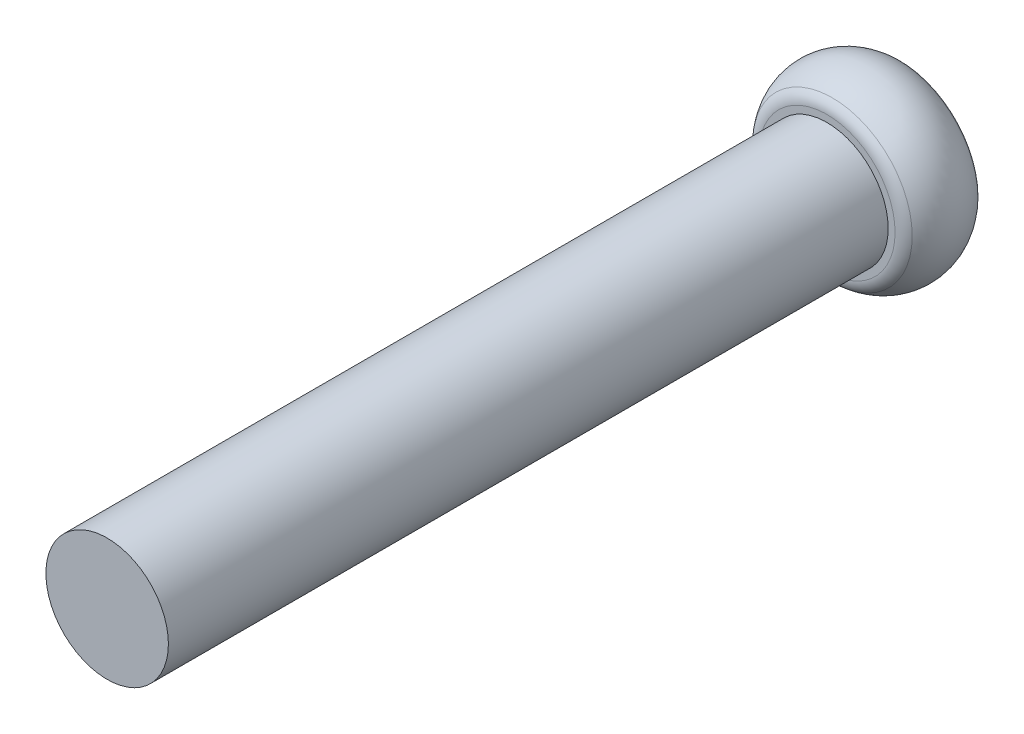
ISO-10303-21;
HEADER;
FILE_DESCRIPTION(('STEP AP214'),'2;1');
FILE_NAME('part.step','',(''),(''),'','','');
FILE_SCHEMA(('AUTOMOTIVE_DESIGN { 1 0 10303 214 1 1 1 1 }'));
ENDSEC;
DATA;
#1=APPLICATION_CONTEXT('core data for automotive mechanical design processes');
#2=APPLICATION_PROTOCOL_DEFINITION('international standard','automotive_design',2000,#1);
#3=PRODUCT_CONTEXT('',#1,'mechanical');
#4=PRODUCT('Part','Part','',(#3));
#5=PRODUCT_RELATED_PRODUCT_CATEGORY('part','',(#4));
#6=PRODUCT_DEFINITION_FORMATION('','',#4);
#7=PRODUCT_DEFINITION_CONTEXT('part definition',#1,'design');
#8=PRODUCT_DEFINITION('design','',#6,#7);
#9=PRODUCT_DEFINITION_SHAPE('','',#8);
#10=(LENGTH_UNIT() NAMED_UNIT(*) SI_UNIT(.MILLI.,.METRE.));
#11=(NAMED_UNIT(*) PLANE_ANGLE_UNIT() SI_UNIT($,.RADIAN.));
#12=(NAMED_UNIT(*) SI_UNIT($,.STERADIAN.) SOLID_ANGLE_UNIT());
#13=UNCERTAINTY_MEASURE_WITH_UNIT(LENGTH_MEASURE(1.E-05),#10,'distance_accuracy_value','');
#14=(GEOMETRIC_REPRESENTATION_CONTEXT(3) GLOBAL_UNCERTAINTY_ASSIGNED_CONTEXT((#13)) GLOBAL_UNIT_ASSIGNED_CONTEXT((#10,
#11,#12)) REPRESENTATION_CONTEXT('',''));
#15=CARTESIAN_POINT('',(0.,0.,0.));
#16=DIRECTION('',(0.,0.,1.));
#17=DIRECTION('',(1.,0.,0.));
#18=AXIS2_PLACEMENT_3D('',#15,#16,#17);
#19=CARTESIAN_POINT('',(0.,0.,-10.9468599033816));
#20=DIRECTION('',(0.,0.,1.));
#21=DIRECTION('',(1.,0.,0.));
#22=AXIS2_PLACEMENT_3D('',#19,#20,#21);
#23=PLANE('',#22);
#24=DIRECTION('',(0.923879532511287,0.38268343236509,0.));
#25=VECTOR('',#24,1.);
#26=CARTESIAN_POINT('',(0.,2.,-10.9468599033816));
#27=LINE('',#26,#25);
#28=CARTESIAN_POINT('',(-1.4142135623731,1.4142135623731,-10.9468599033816));
#29=VERTEX_POINT('',#28);
#30=CARTESIAN_POINT('',(0.,2.,-10.9468599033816));
#31=VERTEX_POINT('',#30);
#32=EDGE_CURVE('E137',#29,#31,#27,.T.);
#33=ORIENTED_EDGE('',*,*,#32,.F.);
#34=DIRECTION('',(0.38268343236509,0.923879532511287,0.));
#35=VECTOR('',#34,1.);
#36=CARTESIAN_POINT('',(-1.4142135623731,1.4142135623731,-10.9468599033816));
#37=LINE('',#36,#35);
#38=CARTESIAN_POINT('',(-2.,0.,-10.9468599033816));
#39=VERTEX_POINT('',#38);
#40=EDGE_CURVE('E51',#39,#29,#37,.T.);
#41=ORIENTED_EDGE('',*,*,#40,.F.);
#42=DIRECTION('',(-0.38268343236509,0.923879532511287,0.));
#43=VECTOR('',#42,1.);
#44=CARTESIAN_POINT('',(-2.,0.,-10.9468599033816));
#45=LINE('',#44,#43);
#46=CARTESIAN_POINT('',(-1.4142135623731,-1.41421356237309,-10.9468599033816));
#47=VERTEX_POINT('',#46);
#48=EDGE_CURVE('E152',#47,#39,#45,.T.);
#49=ORIENTED_EDGE('',*,*,#48,.F.);
#50=DIRECTION('',(-0.923879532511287,0.38268343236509,0.));
#51=VECTOR('',#50,1.);
#52=CARTESIAN_POINT('',(-1.4142135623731,-1.41421356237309,-10.9468599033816));
#53=LINE('',#52,#51);
#54=CARTESIAN_POINT('',(0.,-2.,-10.9468599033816));
#55=VERTEX_POINT('',#54);
#56=EDGE_CURVE('E150',#55,#47,#53,.T.);
#57=ORIENTED_EDGE('',*,*,#56,.F.);
#58=DIRECTION('',(-0.923879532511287,-0.38268343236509,0.));
#59=VECTOR('',#58,1.);
#60=CARTESIAN_POINT('',(0.,-2.,-10.9468599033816));
#61=LINE('',#60,#59);
#62=CARTESIAN_POINT('',(1.41421356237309,-1.4142135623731,-10.9468599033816));
#63=VERTEX_POINT('',#62);
#64=EDGE_CURVE('E111',#63,#55,#61,.T.);
#65=ORIENTED_EDGE('',*,*,#64,.F.);
#66=DIRECTION('',(-0.38268343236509,-0.923879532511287,0.));
#67=VECTOR('',#66,1.);
#68=CARTESIAN_POINT('',(1.41421356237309,-1.4142135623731,-10.9468599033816));
#69=LINE('',#68,#67);
#70=CARTESIAN_POINT('',(2.,0.,-10.9468599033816));
#71=VERTEX_POINT('',#70);
#72=EDGE_CURVE('E146',#71,#63,#69,.T.);
#73=ORIENTED_EDGE('',*,*,#72,.F.);
#74=DIRECTION('',(0.38268343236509,-0.923879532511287,0.));
#75=VECTOR('',#74,1.);
#76=CARTESIAN_POINT('',(2.,0.,-10.9468599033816));
#77=LINE('',#76,#75);
#78=CARTESIAN_POINT('',(1.4142135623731,1.41421356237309,-10.9468599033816));
#79=VERTEX_POINT('',#78);
#80=EDGE_CURVE('E143',#79,#71,#77,.T.);
#81=ORIENTED_EDGE('',*,*,#80,.F.);
#82=DIRECTION('',(0.923879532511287,-0.38268343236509,0.));
#83=VECTOR('',#82,1.);
#84=CARTESIAN_POINT('',(1.4142135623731,1.41421356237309,-10.9468599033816));
#85=LINE('',#84,#83);
#86=EDGE_CURVE('E140',#31,#79,#85,.T.);
#87=ORIENTED_EDGE('',*,*,#86,.F.);
#88=EDGE_LOOP('',(#33,#41,#49,#57,#65,#73,#81,#87));
#89=FACE_BOUND('',#88,.T.);
#90=CARTESIAN_POINT('',(0.,0.,-10.9468599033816));
#91=DIRECTION('',(0.,0.,1.));
#92=DIRECTION('',(1.,0.,0.));
#93=AXIS2_PLACEMENT_3D('',#90,#91,#92);
#94=CIRCLE('',#93,2.22590437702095);
#95=CARTESIAN_POINT('',(2.22590437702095,0.,-10.9468599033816));
#96=VERTEX_POINT('',#95);
#97=EDGE_CURVE('E11',#96,#96,#94,.T.);
#98=ORIENTED_EDGE('',*,*,#97,.F.);
#99=EDGE_LOOP('',(#98));
#100=FACE_BOUND('',#99,.T.);
#101=ADVANCED_FACE('F37',(#89,#100),#23,.F.);
#102=CARTESIAN_POINT('',(0.,0.,-10.4468599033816));
#103=DIRECTION('',(0.,0.,1.));
#104=DIRECTION('',(1.,0.,0.));
#105=AXIS2_PLACEMENT_3D('',#102,#103,#104);
#106=TOROIDAL_SURFACE('',#105,2.22590437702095,0.500000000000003);
#107=CARTESIAN_POINT('',(0.,0.,-10.7692604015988));
#108=DIRECTION('',(0.,0.,1.));
#109=DIRECTION('',(1.,0.,0.));
#110=AXIS2_PLACEMENT_3D('',#107,#108,#109);
#111=CIRCLE('',#110,2.60807962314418);
#112=CARTESIAN_POINT('',(2.60807962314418,0.,-10.7692604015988));
#113=VERTEX_POINT('',#112);
#114=EDGE_CURVE('E44',#113,#113,#111,.T.);
#115=ORIENTED_EDGE('',*,*,#114,.F.);
#116=EDGE_LOOP('',(#115));
#117=FACE_BOUND('',#116,.T.);
#118=ORIENTED_EDGE('',*,*,#97,.T.);
#119=EDGE_LOOP('',(#118));
#120=FACE_BOUND('',#119,.T.);
#121=ADVANCED_FACE('F181',(#117,#120),#106,.T.);
#122=CARTESIAN_POINT('',(0.,0.,-9.69685990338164));
#123=DIRECTION('',(0.,0.,1.));
#124=DIRECTION('',(1.,0.,0.));
#125=AXIS2_PLACEMENT_3D('',#122,#123,#124);
#126=DEGENERATE_TOROIDAL_SURFACE('',#125,1.33685043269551,1.66314956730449,.T.);
#127=CARTESIAN_POINT('',(0.,0.,-8.62445940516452));
#128=DIRECTION('',(0.,0.,1.));
#129=DIRECTION('',(1.,0.,0.));
#130=AXIS2_PLACEMENT_3D('',#127,#128,#129);
#131=CIRCLE('',#130,2.60807962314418);
#132=CARTESIAN_POINT('',(2.60807962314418,0.,-8.62445940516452));
#133=VERTEX_POINT('',#132);
#134=EDGE_CURVE('E174',#133,#133,#131,.T.);
#135=ORIENTED_EDGE('',*,*,#134,.F.);
#136=EDGE_LOOP('',(#135));
#137=FACE_BOUND('',#136,.T.);
#138=ORIENTED_EDGE('',*,*,#114,.T.);
#139=EDGE_LOOP('',(#138));
#140=FACE_BOUND('',#139,.T.);
#141=ADVANCED_FACE('F179',(#137,#140),#126,.T.);
#142=CARTESIAN_POINT('',(0.,0.,-8.94685990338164));
#143=DIRECTION('',(0.,0.,1.));
#144=DIRECTION('',(1.,0.,0.));
#145=AXIS2_PLACEMENT_3D('',#142,#143,#144);
#146=TOROIDAL_SURFACE('',#145,2.22590437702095,0.500000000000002);
#147=CARTESIAN_POINT('',(0.,0.,-8.44685990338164));
#148=DIRECTION('',(0.,0.,1.));
#149=DIRECTION('',(1.,0.,0.));
#150=AXIS2_PLACEMENT_3D('',#147,#148,#149);
#151=CIRCLE('',#150,2.22590437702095);
#152=CARTESIAN_POINT('',(2.22590437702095,0.,-8.44685990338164));
#153=VERTEX_POINT('',#152);
#154=EDGE_CURVE('E171',#153,#153,#151,.T.);
#155=ORIENTED_EDGE('',*,*,#154,.F.);
#156=EDGE_LOOP('',(#155));
#157=FACE_BOUND('',#156,.T.);
#158=ORIENTED_EDGE('',*,*,#134,.T.);
#159=EDGE_LOOP('',(#158));
#160=FACE_BOUND('',#159,.T.);
#161=ADVANCED_FACE('F245',(#157,#160),#146,.T.);
#162=CARTESIAN_POINT('',(0.,2.,-8.44685990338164));
#163=DIRECTION('',(0.,0.,-1.));
#164=DIRECTION('',(-1.,0.,0.));
#165=AXIS2_PLACEMENT_3D('',#162,#163,#164);
#166=PLANE('',#165);
#167=CARTESIAN_POINT('',(0.,0.,-8.44685990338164));
#168=DIRECTION('',(0.,0.,1.));
#169=DIRECTION('',(1.,0.,0.));
#170=AXIS2_PLACEMENT_3D('',#167,#168,#169);
#171=CIRCLE('',#170,2.);
#172=CARTESIAN_POINT('',(2.,0.,-8.44685990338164));
#173=VERTEX_POINT('',#172);
#174=EDGE_CURVE('E168',#173,#173,#171,.T.);
#175=ORIENTED_EDGE('',*,*,#174,.F.);
#176=EDGE_LOOP('',(#175));
#177=FACE_BOUND('',#176,.T.);
#178=ORIENTED_EDGE('',*,*,#154,.T.);
#179=EDGE_LOOP('',(#178));
#180=FACE_BOUND('',#179,.T.);
#181=ADVANCED_FACE('F241',(#177,#180),#166,.F.);
#182=CARTESIAN_POINT('',(0.,0.,15.0531400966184));
#183=DIRECTION('',(0.,0.,1.));
#184=DIRECTION('',(1.,0.,0.));
#185=AXIS2_PLACEMENT_3D('',#182,#183,#184);
#186=CYLINDRICAL_SURFACE('',#185,2.);
#187=CARTESIAN_POINT('',(0.,0.,15.0531400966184));
#188=DIRECTION('',(0.,0.,1.));
#189=DIRECTION('',(1.,0.,0.));
#190=AXIS2_PLACEMENT_3D('',#187,#188,#189);
#191=CIRCLE('',#190,2.);
#192=CARTESIAN_POINT('',(2.,0.,15.0531400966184));
#193=VERTEX_POINT('',#192);
#194=EDGE_CURVE('E156',#193,#193,#191,.T.);
#195=ORIENTED_EDGE('',*,*,#194,.F.);
#196=EDGE_LOOP('',(#195));
#197=FACE_BOUND('',#196,.T.);
#198=ORIENTED_EDGE('',*,*,#174,.T.);
#199=EDGE_LOOP('',(#198));
#200=FACE_BOUND('',#199,.T.);
#201=ADVANCED_FACE('F237',(#197,#200),#186,.T.);
#202=CARTESIAN_POINT('',(0.,2.,15.0531400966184));
#203=DIRECTION('',(0.,0.,-1.));
#204=DIRECTION('',(-1.,0.,0.));
#205=AXIS2_PLACEMENT_3D('',#202,#203,#204);
#206=PLANE('',#205);
#207=ORIENTED_EDGE('',*,*,#194,.T.);
#208=EDGE_LOOP('',(#207));
#209=FACE_BOUND('',#208,.T.);
#210=ADVANCED_FACE('F219',(#209),#206,.F.);
#211=CARTESIAN_POINT('',(-1.4142135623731,1.4142135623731,-9.44685990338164));
#212=DIRECTION('',(-0.923879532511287,0.38268343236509,0.));
#213=DIRECTION('',(-0.38268343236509,-0.923879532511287,0.));
#214=AXIS2_PLACEMENT_3D('',#211,#212,#213);
#215=PLANE('',#214);
#216=ORIENTED_EDGE('',*,*,#40,.T.);
#217=DIRECTION('',(0.,0.,-1.));
#218=VECTOR('',#217,1.);
#219=CARTESIAN_POINT('',(-1.4142135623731,1.4142135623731,-9.44685990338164));
#220=LINE('',#219,#218);
#221=CARTESIAN_POINT('',(-1.4142135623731,1.4142135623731,-9.44685990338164));
#222=VERTEX_POINT('',#221);
#223=EDGE_CURVE('E87',#222,#29,#220,.T.);
#224=ORIENTED_EDGE('',*,*,#223,.F.);
#225=DIRECTION('',(0.38268343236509,0.923879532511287,0.));
#226=VECTOR('',#225,1.);
#227=CARTESIAN_POINT('',(-1.4142135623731,1.4142135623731,-9.44685990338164));
#228=LINE('',#227,#226);
#229=CARTESIAN_POINT('',(-2.,0.,-9.44685990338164));
#230=VERTEX_POINT('',#229);
#231=EDGE_CURVE('E154',#230,#222,#228,.T.);
#232=ORIENTED_EDGE('',*,*,#231,.F.);
#233=DIRECTION('',(0.,0.,-1.));
#234=VECTOR('',#233,1.);
#235=CARTESIAN_POINT('',(-2.,0.,-9.44685990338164));
#236=LINE('',#235,#234);
#237=EDGE_CURVE('E59',#230,#39,#236,.T.);
#238=ORIENTED_EDGE('',*,*,#237,.T.);
#239=EDGE_LOOP('',(#216,#224,#232,#238));
#240=FACE_BOUND('',#239,.T.);
#241=ADVANCED_FACE('F212',(#240),#215,.F.);
#242=CARTESIAN_POINT('',(-2.,0.,-9.44685990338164));
#243=DIRECTION('',(-0.923879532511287,-0.38268343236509,0.));
#244=DIRECTION('',(0.38268343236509,-0.923879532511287,0.));
#245=AXIS2_PLACEMENT_3D('',#242,#243,#244);
#246=PLANE('',#245);
#247=ORIENTED_EDGE('',*,*,#48,.T.);
#248=ORIENTED_EDGE('',*,*,#237,.F.);
#249=DIRECTION('',(-0.38268343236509,0.923879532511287,0.));
#250=VECTOR('',#249,1.);
#251=CARTESIAN_POINT('',(-2.,0.,-9.44685990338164));
#252=LINE('',#251,#250);
#253=CARTESIAN_POINT('',(-1.4142135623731,-1.41421356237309,-9.44685990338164));
#254=VERTEX_POINT('',#253);
#255=EDGE_CURVE('E123',#254,#230,#252,.T.);
#256=ORIENTED_EDGE('',*,*,#255,.F.);
#257=DIRECTION('',(0.,0.,-1.));
#258=VECTOR('',#257,1.);
#259=CARTESIAN_POINT('',(-1.4142135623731,-1.41421356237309,-9.44685990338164));
#260=LINE('',#259,#258);
#261=EDGE_CURVE('E115',#254,#47,#260,.T.);
#262=ORIENTED_EDGE('',*,*,#261,.T.);
#263=EDGE_LOOP('',(#247,#248,#256,#262));
#264=FACE_BOUND('',#263,.T.);
#265=ADVANCED_FACE('F210',(#264),#246,.F.);
#266=CARTESIAN_POINT('',(-1.4142135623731,-1.41421356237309,-9.44685990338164));
#267=DIRECTION('',(-0.38268343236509,-0.923879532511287,0.));
#268=DIRECTION('',(0.923879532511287,-0.38268343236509,0.));
#269=AXIS2_PLACEMENT_3D('',#266,#267,#268);
#270=PLANE('',#269);
#271=ORIENTED_EDGE('',*,*,#56,.T.);
#272=ORIENTED_EDGE('',*,*,#261,.F.);
#273=DIRECTION('',(-0.923879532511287,0.38268343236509,0.));
#274=VECTOR('',#273,1.);
#275=CARTESIAN_POINT('',(-1.4142135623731,-1.41421356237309,-9.44685990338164));
#276=LINE('',#275,#274);
#277=CARTESIAN_POINT('',(0.,-2.,-9.44685990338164));
#278=VERTEX_POINT('',#277);
#279=EDGE_CURVE('E119',#278,#254,#276,.T.);
#280=ORIENTED_EDGE('',*,*,#279,.F.);
#281=DIRECTION('',(0.,0.,-1.));
#282=VECTOR('',#281,1.);
#283=CARTESIAN_POINT('',(0.,-2.,-9.44685990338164));
#284=LINE('',#283,#282);
#285=EDGE_CURVE('E104',#278,#55,#284,.T.);
#286=ORIENTED_EDGE('',*,*,#285,.T.);
#287=EDGE_LOOP('',(#271,#272,#280,#286));
#288=FACE_BOUND('',#287,.T.);
#289=ADVANCED_FACE('F120',(#288),#270,.F.);
#290=CARTESIAN_POINT('',(0.,-2.,-9.44685990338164));
#291=DIRECTION('',(0.38268343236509,-0.923879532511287,0.));
#292=DIRECTION('',(0.923879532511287,0.38268343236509,0.));
#293=AXIS2_PLACEMENT_3D('',#290,#291,#292);
#294=PLANE('',#293);
#295=ORIENTED_EDGE('',*,*,#64,.T.);
#296=ORIENTED_EDGE('',*,*,#285,.F.);
#297=DIRECTION('',(-0.923879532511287,-0.38268343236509,0.));
#298=VECTOR('',#297,1.);
#299=CARTESIAN_POINT('',(0.,-2.,-9.44685990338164));
#300=LINE('',#299,#298);
#301=CARTESIAN_POINT('',(1.41421356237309,-1.4142135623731,-9.44685990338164));
#302=VERTEX_POINT('',#301);
#303=EDGE_CURVE('E108',#302,#278,#300,.T.);
#304=ORIENTED_EDGE('',*,*,#303,.F.);
#305=DIRECTION('',(0.,0.,-1.));
#306=VECTOR('',#305,1.);
#307=CARTESIAN_POINT('',(1.41421356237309,-1.4142135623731,-9.44685990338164));
#308=LINE('',#307,#306);
#309=EDGE_CURVE('E116',#302,#63,#308,.T.);
#310=ORIENTED_EDGE('',*,*,#309,.T.);
#311=EDGE_LOOP('',(#295,#296,#304,#310));
#312=FACE_BOUND('',#311,.T.);
#313=ADVANCED_FACE('F106',(#312),#294,.F.);
#314=CARTESIAN_POINT('',(1.41421356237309,-1.4142135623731,-9.44685990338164));
#315=DIRECTION('',(0.923879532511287,-0.38268343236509,0.));
#316=DIRECTION('',(0.38268343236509,0.923879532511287,0.));
#317=AXIS2_PLACEMENT_3D('',#314,#315,#316);
#318=PLANE('',#317);
#319=ORIENTED_EDGE('',*,*,#72,.T.);
#320=ORIENTED_EDGE('',*,*,#309,.F.);
#321=DIRECTION('',(-0.38268343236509,-0.923879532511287,0.));
#322=VECTOR('',#321,1.);
#323=CARTESIAN_POINT('',(1.41421356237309,-1.4142135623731,-9.44685990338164));
#324=LINE('',#323,#322);
#325=CARTESIAN_POINT('',(2.,0.,-9.44685990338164));
#326=VERTEX_POINT('',#325);
#327=EDGE_CURVE('E129',#326,#302,#324,.T.);
#328=ORIENTED_EDGE('',*,*,#327,.F.);
#329=DIRECTION('',(0.,0.,-1.));
#330=VECTOR('',#329,1.);
#331=CARTESIAN_POINT('',(2.,0.,-9.44685990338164));
#332=LINE('',#331,#330);
#333=EDGE_CURVE('E159',#326,#71,#332,.T.);
#334=ORIENTED_EDGE('',*,*,#333,.T.);
#335=EDGE_LOOP('',(#319,#320,#328,#334));
#336=FACE_BOUND('',#335,.T.);
#337=ADVANCED_FACE('F209',(#336),#318,.F.);
#338=CARTESIAN_POINT('',(2.,0.,-9.44685990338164));
#339=DIRECTION('',(0.923879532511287,0.38268343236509,0.));
#340=DIRECTION('',(-0.38268343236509,0.923879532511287,0.));
#341=AXIS2_PLACEMENT_3D('',#338,#339,#340);
#342=PLANE('',#341);
#343=ORIENTED_EDGE('',*,*,#80,.T.);
#344=ORIENTED_EDGE('',*,*,#333,.F.);
#345=DIRECTION('',(0.38268343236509,-0.923879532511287,0.));
#346=VECTOR('',#345,1.);
#347=CARTESIAN_POINT('',(2.,0.,-9.44685990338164));
#348=LINE('',#347,#346);
#349=CARTESIAN_POINT('',(1.4142135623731,1.41421356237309,-9.44685990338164));
#350=VERTEX_POINT('',#349);
#351=EDGE_CURVE('E131',#350,#326,#348,.T.);
#352=ORIENTED_EDGE('',*,*,#351,.F.);
#353=DIRECTION('',(0.,0.,-1.));
#354=VECTOR('',#353,1.);
#355=CARTESIAN_POINT('',(1.4142135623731,1.41421356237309,-9.44685990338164));
#356=LINE('',#355,#354);
#357=EDGE_CURVE('E161',#350,#79,#356,.T.);
#358=ORIENTED_EDGE('',*,*,#357,.T.);
#359=EDGE_LOOP('',(#343,#344,#352,#358));
#360=FACE_BOUND('',#359,.T.);
#361=ADVANCED_FACE('F206',(#360),#342,.F.);
#362=CARTESIAN_POINT('',(1.4142135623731,1.41421356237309,-9.44685990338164));
#363=DIRECTION('',(0.38268343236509,0.923879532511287,0.));
#364=DIRECTION('',(-0.923879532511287,0.38268343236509,0.));
#365=AXIS2_PLACEMENT_3D('',#362,#363,#364);
#366=PLANE('',#365);
#367=ORIENTED_EDGE('',*,*,#86,.T.);
#368=ORIENTED_EDGE('',*,*,#357,.F.);
#369=DIRECTION('',(0.923879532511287,-0.38268343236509,0.));
#370=VECTOR('',#369,1.);
#371=CARTESIAN_POINT('',(1.4142135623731,1.41421356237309,-9.44685990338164));
#372=LINE('',#371,#370);
#373=CARTESIAN_POINT('',(0.,2.,-9.44685990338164));
#374=VERTEX_POINT('',#373);
#375=EDGE_CURVE('E200',#374,#350,#372,.T.);
#376=ORIENTED_EDGE('',*,*,#375,.F.);
#377=DIRECTION('',(0.,0.,-1.));
#378=VECTOR('',#377,1.);
#379=CARTESIAN_POINT('',(0.,2.,-9.44685990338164));
#380=LINE('',#379,#378);
#381=EDGE_CURVE('E163',#374,#31,#380,.T.);
#382=ORIENTED_EDGE('',*,*,#381,.T.);
#383=EDGE_LOOP('',(#367,#368,#376,#382));
#384=FACE_BOUND('',#383,.T.);
#385=ADVANCED_FACE('F229',(#384),#366,.F.);
#386=CARTESIAN_POINT('',(0.,2.,-9.44685990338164));
#387=DIRECTION('',(-0.38268343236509,0.923879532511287,0.));
#388=DIRECTION('',(-0.923879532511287,-0.38268343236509,0.));
#389=AXIS2_PLACEMENT_3D('',#386,#387,#388);
#390=PLANE('',#389);
#391=ORIENTED_EDGE('',*,*,#32,.T.);
#392=ORIENTED_EDGE('',*,*,#381,.F.);
#393=DIRECTION('',(0.923879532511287,0.38268343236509,0.));
#394=VECTOR('',#393,1.);
#395=CARTESIAN_POINT('',(0.,2.,-9.44685990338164));
#396=LINE('',#395,#394);
#397=EDGE_CURVE('E198',#222,#374,#396,.T.);
#398=ORIENTED_EDGE('',*,*,#397,.F.);
#399=ORIENTED_EDGE('',*,*,#223,.T.);
#400=EDGE_LOOP('',(#391,#392,#398,#399));
#401=FACE_BOUND('',#400,.T.);
#402=ADVANCED_FACE('F195',(#401),#390,.F.);
#403=CARTESIAN_POINT('',(0.,0.,-9.44685990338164));
#404=DIRECTION('',(0.,0.,1.));
#405=DIRECTION('',(1.,0.,0.));
#406=AXIS2_PLACEMENT_3D('',#403,#404,#405);
#407=PLANE('',#406);
#408=ORIENTED_EDGE('',*,*,#231,.T.);
#409=ORIENTED_EDGE('',*,*,#397,.T.);
#410=ORIENTED_EDGE('',*,*,#375,.T.);
#411=ORIENTED_EDGE('',*,*,#351,.T.);
#412=ORIENTED_EDGE('',*,*,#327,.T.);
#413=ORIENTED_EDGE('',*,*,#303,.T.);
#414=ORIENTED_EDGE('',*,*,#279,.T.);
#415=ORIENTED_EDGE('',*,*,#255,.T.);
#416=EDGE_LOOP('',(#408,#409,#410,#411,#412,#413,#414,#415));
#417=FACE_BOUND('',#416,.T.);
#418=ADVANCED_FACE('F126',(#417),#407,.F.);
#419=CLOSED_SHELL('',(#101,#121,#141,#161,#181,#201,#210,#241,#265,#289,#313,#337,#361,#385,
#402,#418));
#420=MANIFOLD_SOLID_BREP('B2',#419);
#421=ADVANCED_BREP_SHAPE_REPRESENTATION('',(#18,#420),#14);
#422=SHAPE_DEFINITION_REPRESENTATION(#9,#421);
ENDSEC;
END-ISO-10303-21;
